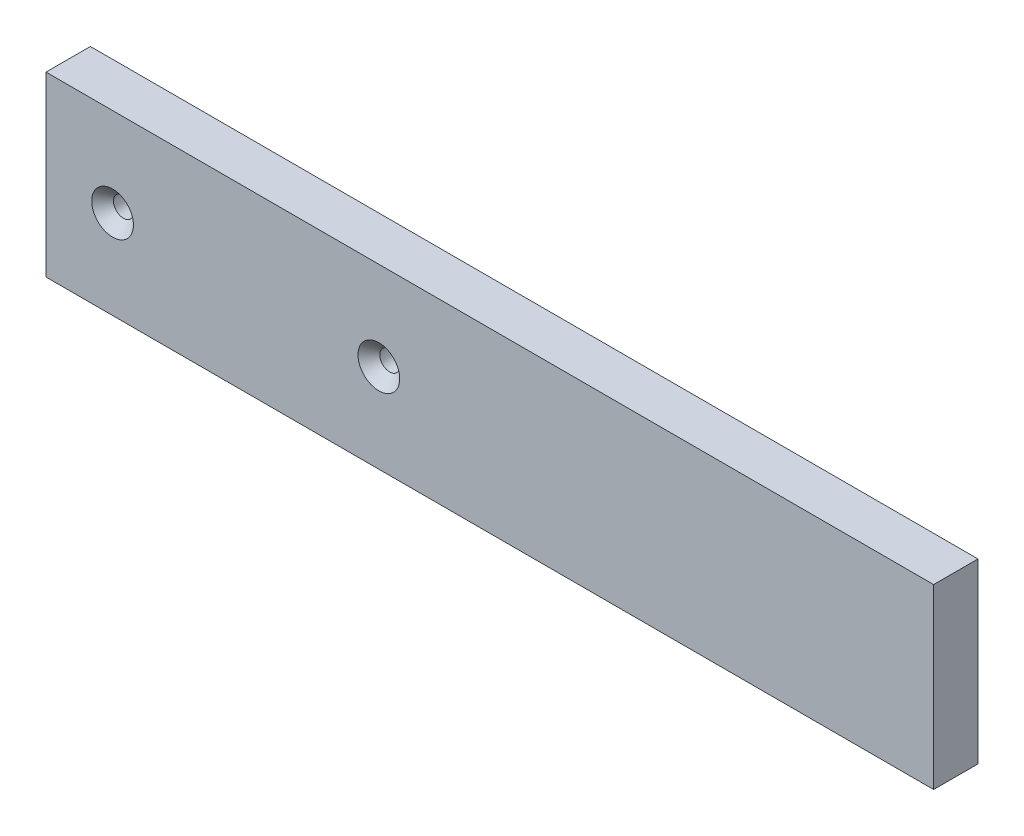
from build123d import *

# Parameters (mm, degrees)
SKETCH1_W                                           = 200
SKETCH1_H                                           = 40
BOSS_EXTRUDE1_DEPTH                                 = 5
CSK_FOR_M4_COUNTERSUNK_FLAT_HEAD_SCREW1_D           = 4.5
CSK_FOR_M4_COUNTERSUNK_FLAT_HEAD_SCREW1_CSINK_D     = 9.4
CSK_FOR_M4_COUNTERSUNK_FLAT_HEAD_SCREW1_CSINK_ANGLE = 90


with BuildPart() as part:
    # Sketch1 → Boss-Extrude1 (new, symmetric)
    with BuildSketch(Plane.XY):
        Rectangle(SKETCH1_W, SKETCH1_H)
    extrude(amount=BOSS_EXTRUDE1_DEPTH, both=True)

    # CSK for M4 Countersunk Flat Head Screw1 (through all)
    with Locations(Plane(origin=(-37.16236966, 155, 5), x_dir=(0, -1, 0), z_dir=(0, 0, 1))):
        with Locations((155, 12.16236966), (155, -47.83763034)):
            CounterSinkHole(CSK_FOR_M4_COUNTERSUNK_FLAT_HEAD_SCREW1_D / 2, CSK_FOR_M4_COUNTERSUNK_FLAT_HEAD_SCREW1_CSINK_D / 2, counter_sink_angle=CSK_FOR_M4_COUNTERSUNK_FLAT_HEAD_SCREW1_CSINK_ANGLE)


solid = part.part
